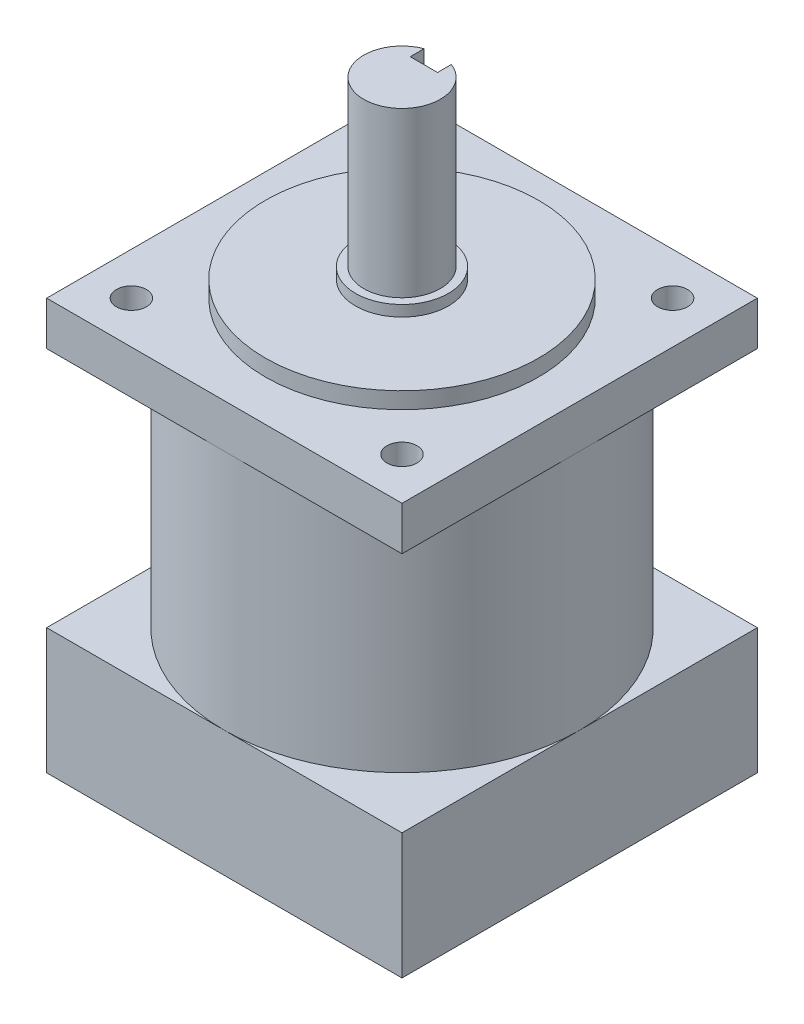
ISO-10303-21;
HEADER;
FILE_DESCRIPTION(('STEP AP214'),'2;1');
FILE_NAME('part.step','',(''),(''),'','','');
FILE_SCHEMA(('AUTOMOTIVE_DESIGN { 1 0 10303 214 1 1 1 1 }'));
ENDSEC;
DATA;
#1=APPLICATION_CONTEXT('core data for automotive mechanical design processes');
#2=APPLICATION_PROTOCOL_DEFINITION('international standard','automotive_design',2000,#1);
#3=PRODUCT_CONTEXT('',#1,'mechanical');
#4=PRODUCT('Part','Part','',(#3));
#5=PRODUCT_RELATED_PRODUCT_CATEGORY('part','',(#4));
#6=PRODUCT_DEFINITION_FORMATION('','',#4);
#7=PRODUCT_DEFINITION_CONTEXT('part definition',#1,'design');
#8=PRODUCT_DEFINITION('design','',#6,#7);
#9=PRODUCT_DEFINITION_SHAPE('','',#8);
#10=(LENGTH_UNIT() NAMED_UNIT(*) SI_UNIT(.MILLI.,.METRE.));
#11=(NAMED_UNIT(*) PLANE_ANGLE_UNIT() SI_UNIT($,.RADIAN.));
#12=(NAMED_UNIT(*) SI_UNIT($,.STERADIAN.) SOLID_ANGLE_UNIT());
#13=UNCERTAINTY_MEASURE_WITH_UNIT(LENGTH_MEASURE(1.E-05),#10,'distance_accuracy_value','');
#14=(GEOMETRIC_REPRESENTATION_CONTEXT(3) GLOBAL_UNCERTAINTY_ASSIGNED_CONTEXT((#13)) GLOBAL_UNIT_ASSIGNED_CONTEXT((#10,
#11,#12)) REPRESENTATION_CONTEXT('',''));
#15=CARTESIAN_POINT('',(0.,0.,0.));
#16=DIRECTION('',(0.,0.,1.));
#17=DIRECTION('',(1.,0.,0.));
#18=AXIS2_PLACEMENT_3D('',#15,#16,#17);
#19=CARTESIAN_POINT('',(0.,13.,0.));
#20=DIRECTION('',(0.,1.,0.));
#21=DIRECTION('',(0.,0.,1.));
#22=AXIS2_PLACEMENT_3D('',#19,#20,#21);
#23=PLANE('',#22);
#24=CARTESIAN_POINT('',(0.,13.,0.));
#25=DIRECTION('',(0.,1.,0.));
#26=DIRECTION('',(0.,0.,1.));
#27=AXIS2_PLACEMENT_3D('',#24,#25,#26);
#28=CIRCLE('',#27,8.5);
#29=CARTESIAN_POINT('',(0.,13.,8.5));
#30=VERTEX_POINT('',#29);
#31=EDGE_CURVE('E277',#30,#30,#28,.T.);
#32=ORIENTED_EDGE('',*,*,#31,.T.);
#33=EDGE_LOOP('',(#32));
#34=FACE_BOUND('',#33,.T.);
#35=DIRECTION('',(0.,0.,-1.));
#36=VECTOR('',#35,1.);
#37=CARTESIAN_POINT('',(2.5,13.,-9.));
#38=LINE('',#37,#36);
#39=CARTESIAN_POINT('',(2.5,13.,-4.));
#40=VERTEX_POINT('',#39);
#41=CARTESIAN_POINT('',(2.5,13.,-6.53834841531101));
#42=VERTEX_POINT('',#41);
#43=EDGE_CURVE('E835',#40,#42,#38,.T.);
#44=ORIENTED_EDGE('',*,*,#43,.T.);
#45=CARTESIAN_POINT('',(0.,13.,0.));
#46=DIRECTION('',(0.,1.,0.));
#47=DIRECTION('',(0.,0.,1.));
#48=AXIS2_PLACEMENT_3D('',#45,#46,#47);
#49=CIRCLE('',#48,7.);
#50=CARTESIAN_POINT('',(-2.5,13.,-6.53834841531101));
#51=VERTEX_POINT('',#50);
#52=EDGE_CURVE('E852',#51,#42,#49,.T.);
#53=ORIENTED_EDGE('',*,*,#52,.F.);
#54=DIRECTION('',(0.,0.,1.));
#55=VECTOR('',#54,1.);
#56=CARTESIAN_POINT('',(-2.5,13.,-9.));
#57=LINE('',#56,#55);
#58=CARTESIAN_POINT('',(-2.5,13.,-4.));
#59=VERTEX_POINT('',#58);
#60=EDGE_CURVE('E829',#51,#59,#57,.T.);
#61=ORIENTED_EDGE('',*,*,#60,.T.);
#62=DIRECTION('',(1.,0.,0.));
#63=VECTOR('',#62,1.);
#64=CARTESIAN_POINT('',(-2.5,13.,-4.));
#65=LINE('',#64,#63);
#66=EDGE_CURVE('E831',#59,#40,#65,.T.);
#67=ORIENTED_EDGE('',*,*,#66,.T.);
#68=EDGE_LOOP('',(#44,#53,#61,#67));
#69=FACE_BOUND('',#68,.T.);
#70=ADVANCED_FACE('F16',(#34,#69),#23,.T.);
#71=CARTESIAN_POINT('',(0.,11.,0.));
#72=DIRECTION('',(0.,1.,0.));
#73=DIRECTION('',(0.,0.,1.));
#74=AXIS2_PLACEMENT_3D('',#71,#72,#73);
#75=PLANE('',#74);
#76=CARTESIAN_POINT('',(0.,11.,0.));
#77=DIRECTION('',(0.,1.,0.));
#78=DIRECTION('',(0.,0.,1.));
#79=AXIS2_PLACEMENT_3D('',#76,#77,#78);
#80=CIRCLE('',#79,25.);
#81=CARTESIAN_POINT('',(0.,11.,25.));
#82=VERTEX_POINT('',#81);
#83=EDGE_CURVE('E250',#82,#82,#80,.T.);
#84=ORIENTED_EDGE('',*,*,#83,.T.);
#85=EDGE_LOOP('',(#84));
#86=FACE_BOUND('',#85,.T.);
#87=CARTESIAN_POINT('',(0.,11.,0.));
#88=DIRECTION('',(0.,1.,0.));
#89=DIRECTION('',(0.,0.,1.));
#90=AXIS2_PLACEMENT_3D('',#87,#88,#89);
#91=CIRCLE('',#90,8.5);
#92=CARTESIAN_POINT('',(0.,11.,8.5));
#93=VERTEX_POINT('',#92);
#94=EDGE_CURVE('E856',#93,#93,#91,.T.);
#95=ORIENTED_EDGE('',*,*,#94,.F.);
#96=EDGE_LOOP('',(#95));
#97=FACE_BOUND('',#96,.T.);
#98=ADVANCED_FACE('F324',(#86,#97),#75,.T.);
#99=CARTESIAN_POINT('',(32.5,0.,-32.5));
#100=DIRECTION('',(0.,-1.,0.));
#101=DIRECTION('',(0.,0.,-1.));
#102=AXIS2_PLACEMENT_3D('',#99,#100,#101);
#103=PLANE('',#102);
#104=CARTESIAN_POINT('',(24.7487373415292,0.,-24.7487373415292));
#105=DIRECTION('',(0.,-1.,0.));
#106=DIRECTION('',(0.,0.,-1.));
#107=AXIS2_PLACEMENT_3D('',#104,#105,#106);
#108=CIRCLE('',#107,2.75);
#109=CARTESIAN_POINT('',(22.1871999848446,0.,-23.7482242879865));
#110=VERTEX_POINT('',#109);
#111=CARTESIAN_POINT('',(23.7482242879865,0.,-22.1871999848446));
#112=VERTEX_POINT('',#111);
#113=EDGE_CURVE('E793',#110,#112,#108,.T.);
#114=ORIENTED_EDGE('',*,*,#113,.F.);
#115=CARTESIAN_POINT('',(0.,0.,0.));
#116=DIRECTION('',(0.,-1.,0.));
#117=DIRECTION('',(0.,0.,-1.));
#118=AXIS2_PLACEMENT_3D('',#115,#116,#117);
#119=CIRCLE('',#118,32.5);
#120=CARTESIAN_POINT('',(0.,0.,-32.5));
#121=VERTEX_POINT('',#120);
#122=EDGE_CURVE('E215',#121,#110,#119,.T.);
#123=ORIENTED_EDGE('',*,*,#122,.F.);
#124=DIRECTION('',(-1.,0.,0.));
#125=VECTOR('',#124,1.);
#126=CARTESIAN_POINT('',(-32.5,0.,-32.5));
#127=LINE('',#126,#125);
#128=CARTESIAN_POINT('',(32.5,0.,-32.5));
#129=VERTEX_POINT('',#128);
#130=EDGE_CURVE('E917',#129,#121,#127,.T.);
#131=ORIENTED_EDGE('',*,*,#130,.F.);
#132=DIRECTION('',(0.,0.,-1.));
#133=VECTOR('',#132,1.);
#134=CARTESIAN_POINT('',(32.5,0.,-32.5));
#135=LINE('',#134,#133);
#136=CARTESIAN_POINT('',(32.5,0.,0.));
#137=VERTEX_POINT('',#136);
#138=EDGE_CURVE('E949',#137,#129,#135,.T.);
#139=ORIENTED_EDGE('',*,*,#138,.F.);
#140=EDGE_CURVE('E214',#112,#137,#119,.T.);
#141=ORIENTED_EDGE('',*,*,#140,.F.);
#142=EDGE_LOOP('',(#114,#123,#131,#139,#141));
#143=FACE_BOUND('',#142,.T.);
#144=ADVANCED_FACE('F331',(#143),#103,.T.);
#145=CARTESIAN_POINT('',(24.7487373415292,0.,24.7487373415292));
#146=DIRECTION('',(0.,-1.,0.));
#147=DIRECTION('',(0.,0.,-1.));
#148=AXIS2_PLACEMENT_3D('',#145,#146,#147);
#149=CIRCLE('',#148,2.75);
#150=CARTESIAN_POINT('',(23.7482242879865,0.,22.1871999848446));
#151=VERTEX_POINT('',#150);
#152=CARTESIAN_POINT('',(22.1871999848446,0.,23.7482242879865));
#153=VERTEX_POINT('',#152);
#154=EDGE_CURVE('E786',#151,#153,#149,.T.);
#155=ORIENTED_EDGE('',*,*,#154,.F.);
#156=EDGE_CURVE('E213',#137,#151,#119,.T.);
#157=ORIENTED_EDGE('',*,*,#156,.F.);
#158=CARTESIAN_POINT('',(32.5,0.,32.5));
#159=VERTEX_POINT('',#158);
#160=EDGE_CURVE('E950',#159,#137,#135,.T.);
#161=ORIENTED_EDGE('',*,*,#160,.F.);
#162=DIRECTION('',(1.,0.,0.));
#163=VECTOR('',#162,1.);
#164=CARTESIAN_POINT('',(-32.5,0.,32.5));
#165=LINE('',#164,#163);
#166=CARTESIAN_POINT('',(0.,0.,32.5));
#167=VERTEX_POINT('',#166);
#168=EDGE_CURVE('E945',#167,#159,#165,.T.);
#169=ORIENTED_EDGE('',*,*,#168,.F.);
#170=EDGE_CURVE('E206',#153,#167,#119,.T.);
#171=ORIENTED_EDGE('',*,*,#170,.F.);
#172=EDGE_LOOP('',(#155,#157,#161,#169,#171));
#173=FACE_BOUND('',#172,.T.);
#174=ADVANCED_FACE('F457',(#173),#103,.T.);
#175=CARTESIAN_POINT('',(-24.7487373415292,0.,24.7487373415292));
#176=DIRECTION('',(0.,-1.,0.));
#177=DIRECTION('',(0.,0.,-1.));
#178=AXIS2_PLACEMENT_3D('',#175,#176,#177);
#179=CIRCLE('',#178,2.75);
#180=CARTESIAN_POINT('',(-22.1871999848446,0.,23.7482242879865));
#181=VERTEX_POINT('',#180);
#182=CARTESIAN_POINT('',(-23.7482242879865,0.,22.1871999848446));
#183=VERTEX_POINT('',#182);
#184=EDGE_CURVE('E196',#181,#183,#179,.T.);
#185=ORIENTED_EDGE('',*,*,#184,.F.);
#186=EDGE_CURVE('E203',#167,#181,#119,.T.);
#187=ORIENTED_EDGE('',*,*,#186,.F.);
#188=CARTESIAN_POINT('',(-32.5,0.,32.5));
#189=VERTEX_POINT('',#188);
#190=EDGE_CURVE('E941',#189,#167,#165,.T.);
#191=ORIENTED_EDGE('',*,*,#190,.F.);
#192=DIRECTION('',(0.,0.,1.));
#193=VECTOR('',#192,1.);
#194=CARTESIAN_POINT('',(-32.5,0.,-32.5));
#195=LINE('',#194,#193);
#196=CARTESIAN_POINT('',(-32.5,0.,0.));
#197=VERTEX_POINT('',#196);
#198=EDGE_CURVE('E939',#197,#189,#195,.T.);
#199=ORIENTED_EDGE('',*,*,#198,.F.);
#200=EDGE_CURVE('E210',#183,#197,#119,.T.);
#201=ORIENTED_EDGE('',*,*,#200,.F.);
#202=EDGE_LOOP('',(#185,#187,#191,#199,#201));
#203=FACE_BOUND('',#202,.T.);
#204=ADVANCED_FACE('F401',(#203),#103,.T.);
#205=CARTESIAN_POINT('',(32.5,8.,-32.5));
#206=DIRECTION('',(0.,-1.,0.));
#207=DIRECTION('',(0.,0.,-1.));
#208=AXIS2_PLACEMENT_3D('',#205,#206,#207);
#209=PLANE('',#208);
#210=CARTESIAN_POINT('',(-24.7487373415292,8.,24.7487373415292));
#211=DIRECTION('',(0.,1.,0.));
#212=DIRECTION('',(0.,0.,1.));
#213=AXIS2_PLACEMENT_3D('',#210,#211,#212);
#214=CIRCLE('',#213,2.75);
#215=CARTESIAN_POINT('',(-24.7487373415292,8.,27.4987373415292));
#216=VERTEX_POINT('',#215);
#217=EDGE_CURVE('E197',#216,#216,#214,.T.);
#218=ORIENTED_EDGE('',*,*,#217,.F.);
#219=EDGE_LOOP('',(#218));
#220=FACE_BOUND('',#219,.T.);
#221=CARTESIAN_POINT('',(24.7487373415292,8.,24.7487373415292));
#222=DIRECTION('',(0.,1.,0.));
#223=DIRECTION('',(0.,0.,1.));
#224=AXIS2_PLACEMENT_3D('',#221,#222,#223);
#225=CIRCLE('',#224,2.75);
#226=CARTESIAN_POINT('',(24.7487373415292,8.,27.4987373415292));
#227=VERTEX_POINT('',#226);
#228=EDGE_CURVE('E784',#227,#227,#225,.T.);
#229=ORIENTED_EDGE('',*,*,#228,.F.);
#230=EDGE_LOOP('',(#229));
#231=FACE_BOUND('',#230,.T.);
#232=CARTESIAN_POINT('',(24.7487373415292,8.,-24.7487373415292));
#233=DIRECTION('',(0.,1.,0.));
#234=DIRECTION('',(0.,0.,1.));
#235=AXIS2_PLACEMENT_3D('',#232,#233,#234);
#236=CIRCLE('',#235,2.75);
#237=CARTESIAN_POINT('',(24.7487373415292,8.,-21.9987373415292));
#238=VERTEX_POINT('',#237);
#239=EDGE_CURVE('E790',#238,#238,#236,.T.);
#240=ORIENTED_EDGE('',*,*,#239,.F.);
#241=EDGE_LOOP('',(#240));
#242=FACE_BOUND('',#241,.T.);
#243=CARTESIAN_POINT('',(-24.7487373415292,8.,-24.7487373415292));
#244=DIRECTION('',(0.,1.,0.));
#245=DIRECTION('',(0.,0.,1.));
#246=AXIS2_PLACEMENT_3D('',#243,#244,#245);
#247=CIRCLE('',#246,2.75);
#248=CARTESIAN_POINT('',(-24.7487373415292,8.,-21.9987373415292));
#249=VERTEX_POINT('',#248);
#250=EDGE_CURVE('E797',#249,#249,#247,.T.);
#251=ORIENTED_EDGE('',*,*,#250,.F.);
#252=EDGE_LOOP('',(#251));
#253=FACE_BOUND('',#252,.T.);
#254=DIRECTION('',(-1.,0.,0.));
#255=VECTOR('',#254,1.);
#256=CARTESIAN_POINT('',(-32.5,8.,-32.5));
#257=LINE('',#256,#255);
#258=CARTESIAN_POINT('',(32.5,8.,-32.5));
#259=VERTEX_POINT('',#258);
#260=CARTESIAN_POINT('',(-32.5,8.,-32.5));
#261=VERTEX_POINT('',#260);
#262=EDGE_CURVE('E953',#259,#261,#257,.T.);
#263=ORIENTED_EDGE('',*,*,#262,.T.);
#264=DIRECTION('',(0.,0.,1.));
#265=VECTOR('',#264,1.);
#266=CARTESIAN_POINT('',(-32.5,8.,-32.5));
#267=LINE('',#266,#265);
#268=CARTESIAN_POINT('',(-32.5,8.,32.5));
#269=VERTEX_POINT('',#268);
#270=EDGE_CURVE('E975',#261,#269,#267,.T.);
#271=ORIENTED_EDGE('',*,*,#270,.T.);
#272=DIRECTION('',(1.,0.,0.));
#273=VECTOR('',#272,1.);
#274=CARTESIAN_POINT('',(-32.5,8.,32.5));
#275=LINE('',#274,#273);
#276=CARTESIAN_POINT('',(32.5,8.,32.5));
#277=VERTEX_POINT('',#276);
#278=EDGE_CURVE('E974',#269,#277,#275,.T.);
#279=ORIENTED_EDGE('',*,*,#278,.T.);
#280=DIRECTION('',(0.,0.,-1.));
#281=VECTOR('',#280,1.);
#282=CARTESIAN_POINT('',(32.5,8.,-32.5));
#283=LINE('',#282,#281);
#284=EDGE_CURVE('E958',#277,#259,#283,.T.);
#285=ORIENTED_EDGE('',*,*,#284,.T.);
#286=EDGE_LOOP('',(#263,#271,#279,#285));
#287=FACE_BOUND('',#286,.T.);
#288=CARTESIAN_POINT('',(0.,8.,0.));
#289=DIRECTION('',(0.,-1.,0.));
#290=DIRECTION('',(0.,0.,-1.));
#291=AXIS2_PLACEMENT_3D('',#288,#289,#290);
#292=CIRCLE('',#291,25.);
#293=CARTESIAN_POINT('',(0.,8.,-25.));
#294=VERTEX_POINT('',#293);
#295=EDGE_CURVE('E226',#294,#294,#292,.F.);
#296=ORIENTED_EDGE('',*,*,#295,.F.);
#297=EDGE_LOOP('',(#296));
#298=FACE_BOUND('',#297,.T.);
#299=ADVANCED_FACE('F438',(#220,#231,#242,#253,#287,#298),#209,.F.);
#300=CARTESIAN_POINT('',(-32.5,8.,-32.5));
#301=DIRECTION('',(0.,0.,1.));
#302=DIRECTION('',(1.,0.,0.));
#303=AXIS2_PLACEMENT_3D('',#300,#301,#302);
#304=PLANE('',#303);
#305=ORIENTED_EDGE('',*,*,#130,.T.);
#306=CARTESIAN_POINT('',(-32.5,0.,-32.5));
#307=VERTEX_POINT('',#306);
#308=EDGE_CURVE('E257',#121,#307,#127,.T.);
#309=ORIENTED_EDGE('',*,*,#308,.T.);
#310=DIRECTION('',(0.,-1.,0.));
#311=VECTOR('',#310,1.);
#312=CARTESIAN_POINT('',(-32.5,8.,-32.5));
#313=LINE('',#312,#311);
#314=EDGE_CURVE('E232',#261,#307,#313,.T.);
#315=ORIENTED_EDGE('',*,*,#314,.F.);
#316=ORIENTED_EDGE('',*,*,#262,.F.);
#317=DIRECTION('',(0.,-1.,0.));
#318=VECTOR('',#317,1.);
#319=CARTESIAN_POINT('',(32.5,8.,-32.5));
#320=LINE('',#319,#318);
#321=EDGE_CURVE('E954',#259,#129,#320,.T.);
#322=ORIENTED_EDGE('',*,*,#321,.T.);
#323=EDGE_LOOP('',(#305,#309,#315,#316,#322));
#324=FACE_BOUND('',#323,.T.);
#325=ADVANCED_FACE('F18',(#324),#304,.F.);
#326=CARTESIAN_POINT('',(-32.5,8.,-32.5));
#327=DIRECTION('',(1.,0.,0.));
#328=DIRECTION('',(0.,0.,-1.));
#329=AXIS2_PLACEMENT_3D('',#326,#327,#328);
#330=PLANE('',#329);
#331=EDGE_CURVE('E914',#307,#197,#195,.T.);
#332=ORIENTED_EDGE('',*,*,#331,.T.);
#333=ORIENTED_EDGE('',*,*,#198,.T.);
#334=DIRECTION('',(0.,-1.,0.));
#335=VECTOR('',#334,1.);
#336=CARTESIAN_POINT('',(-32.5,8.,32.5));
#337=LINE('',#336,#335);
#338=EDGE_CURVE('E961',#269,#189,#337,.T.);
#339=ORIENTED_EDGE('',*,*,#338,.F.);
#340=ORIENTED_EDGE('',*,*,#270,.F.);
#341=ORIENTED_EDGE('',*,*,#314,.T.);
#342=EDGE_LOOP('',(#332,#333,#339,#340,#341));
#343=FACE_BOUND('',#342,.T.);
#344=ADVANCED_FACE('F421',(#343),#330,.F.);
#345=CARTESIAN_POINT('',(-32.5,8.,32.5));
#346=DIRECTION('',(0.,0.,-1.));
#347=DIRECTION('',(-1.,0.,0.));
#348=AXIS2_PLACEMENT_3D('',#345,#346,#347);
#349=PLANE('',#348);
#350=ORIENTED_EDGE('',*,*,#190,.T.);
#351=ORIENTED_EDGE('',*,*,#168,.T.);
#352=DIRECTION('',(0.,-1.,0.));
#353=VECTOR('',#352,1.);
#354=CARTESIAN_POINT('',(32.5,8.,32.5));
#355=LINE('',#354,#353);
#356=EDGE_CURVE('E957',#277,#159,#355,.T.);
#357=ORIENTED_EDGE('',*,*,#356,.F.);
#358=ORIENTED_EDGE('',*,*,#278,.F.);
#359=ORIENTED_EDGE('',*,*,#338,.T.);
#360=EDGE_LOOP('',(#350,#351,#357,#358,#359));
#361=FACE_BOUND('',#360,.T.);
#362=ADVANCED_FACE('F411',(#361),#349,.F.);
#363=CARTESIAN_POINT('',(32.5,8.,-32.5));
#364=DIRECTION('',(-1.,0.,0.));
#365=DIRECTION('',(0.,0.,1.));
#366=AXIS2_PLACEMENT_3D('',#363,#364,#365);
#367=PLANE('',#366);
#368=ORIENTED_EDGE('',*,*,#160,.T.);
#369=ORIENTED_EDGE('',*,*,#138,.T.);
#370=ORIENTED_EDGE('',*,*,#321,.F.);
#371=ORIENTED_EDGE('',*,*,#284,.F.);
#372=ORIENTED_EDGE('',*,*,#356,.T.);
#373=EDGE_LOOP('',(#368,#369,#370,#371,#372));
#374=FACE_BOUND('',#373,.T.);
#375=ADVANCED_FACE('F398',(#374),#367,.F.);
#376=CARTESIAN_POINT('',(-24.7487373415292,0.,-24.7487373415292));
#377=DIRECTION('',(0.,-1.,0.));
#378=DIRECTION('',(0.,0.,-1.));
#379=AXIS2_PLACEMENT_3D('',#376,#377,#378);
#380=CIRCLE('',#379,2.75);
#381=CARTESIAN_POINT('',(-23.7482242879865,0.,-22.1871999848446));
#382=VERTEX_POINT('',#381);
#383=CARTESIAN_POINT('',(-22.1871999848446,0.,-23.7482242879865));
#384=VERTEX_POINT('',#383);
#385=EDGE_CURVE('E800',#382,#384,#380,.T.);
#386=ORIENTED_EDGE('',*,*,#385,.F.);
#387=EDGE_CURVE('E212',#197,#382,#119,.T.);
#388=ORIENTED_EDGE('',*,*,#387,.F.);
#389=ORIENTED_EDGE('',*,*,#331,.F.);
#390=ORIENTED_EDGE('',*,*,#308,.F.);
#391=EDGE_CURVE('E219',#384,#121,#119,.T.);
#392=ORIENTED_EDGE('',*,*,#391,.F.);
#393=EDGE_LOOP('',(#386,#388,#389,#390,#392));
#394=FACE_BOUND('',#393,.T.);
#395=ADVANCED_FACE('F318',(#394),#103,.T.);
#396=CARTESIAN_POINT('',(0.,11.,0.));
#397=DIRECTION('',(0.,-1.,0.));
#398=DIRECTION('',(0.,0.,-1.));
#399=AXIS2_PLACEMENT_3D('',#396,#397,#398);
#400=CYLINDRICAL_SURFACE('',#399,25.);
#401=ORIENTED_EDGE('',*,*,#83,.F.);
#402=EDGE_LOOP('',(#401));
#403=FACE_BOUND('',#402,.T.);
#404=ORIENTED_EDGE('',*,*,#295,.T.);
#405=EDGE_LOOP('',(#404));
#406=FACE_BOUND('',#405,.T.);
#407=ADVANCED_FACE('F309',(#403,#406),#400,.T.);
#408=CARTESIAN_POINT('',(0.,-44.2,0.));
#409=DIRECTION('',(0.,1.,0.));
#410=DIRECTION('',(0.,0.,1.));
#411=AXIS2_PLACEMENT_3D('',#408,#409,#410);
#412=CYLINDRICAL_SURFACE('',#411,32.5);
#413=ORIENTED_EDGE('',*,*,#186,.T.);
#414=DIRECTION('',(0.,1.,0.));
#415=VECTOR('',#414,1.);
#416=CARTESIAN_POINT('',(-22.1871999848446,3.,23.7482242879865));
#417=LINE('',#416,#415);
#418=CARTESIAN_POINT('',(-22.1871999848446,-2.,23.7482242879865));
#419=VERTEX_POINT('',#418);
#420=EDGE_CURVE('E11',#181,#419,#417,.F.);
#421=ORIENTED_EDGE('',*,*,#420,.T.);
#422=CARTESIAN_POINT('',(0.,-2.,0.));
#423=DIRECTION('',(0.,1.,0.));
#424=DIRECTION('',(0.,0.,1.));
#425=AXIS2_PLACEMENT_3D('',#422,#423,#424);
#426=CIRCLE('',#425,32.5);
#427=CARTESIAN_POINT('',(-23.7482242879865,-2.,22.1871999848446));
#428=VERTEX_POINT('',#427);
#429=EDGE_CURVE('E187',#428,#419,#426,.T.);
#430=ORIENTED_EDGE('',*,*,#429,.F.);
#431=DIRECTION('',(0.,1.,0.));
#432=VECTOR('',#431,1.);
#433=CARTESIAN_POINT('',(-23.7482242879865,3.,22.1871999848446));
#434=LINE('',#433,#432);
#435=EDGE_CURVE('E24',#428,#183,#434,.T.);
#436=ORIENTED_EDGE('',*,*,#435,.T.);
#437=ORIENTED_EDGE('',*,*,#200,.T.);
#438=ORIENTED_EDGE('',*,*,#387,.T.);
#439=DIRECTION('',(0.,1.,0.));
#440=VECTOR('',#439,1.);
#441=CARTESIAN_POINT('',(-23.7482242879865,3.,-22.1871999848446));
#442=LINE('',#441,#440);
#443=CARTESIAN_POINT('',(-23.7482242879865,-2.,-22.1871999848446));
#444=VERTEX_POINT('',#443);
#445=EDGE_CURVE('E907',#382,#444,#442,.F.);
#446=ORIENTED_EDGE('',*,*,#445,.T.);
#447=CARTESIAN_POINT('',(0.,-2.,0.));
#448=DIRECTION('',(0.,1.,0.));
#449=DIRECTION('',(0.,0.,1.));
#450=AXIS2_PLACEMENT_3D('',#447,#448,#449);
#451=CIRCLE('',#450,32.5);
#452=CARTESIAN_POINT('',(-22.1871999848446,-2.,-23.7482242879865));
#453=VERTEX_POINT('',#452);
#454=EDGE_CURVE('E224',#453,#444,#451,.T.);
#455=ORIENTED_EDGE('',*,*,#454,.F.);
#456=DIRECTION('',(0.,1.,0.));
#457=VECTOR('',#456,1.);
#458=CARTESIAN_POINT('',(-22.1871999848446,3.,-23.7482242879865));
#459=LINE('',#458,#457);
#460=EDGE_CURVE('E904',#453,#384,#459,.T.);
#461=ORIENTED_EDGE('',*,*,#460,.T.);
#462=ORIENTED_EDGE('',*,*,#391,.T.);
#463=ORIENTED_EDGE('',*,*,#122,.T.);
#464=DIRECTION('',(0.,1.,0.));
#465=VECTOR('',#464,1.);
#466=CARTESIAN_POINT('',(22.1871999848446,3.,-23.7482242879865));
#467=LINE('',#466,#465);
#468=CARTESIAN_POINT('',(22.1871999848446,-2.,-23.7482242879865));
#469=VERTEX_POINT('',#468);
#470=EDGE_CURVE('E924',#110,#469,#467,.F.);
#471=ORIENTED_EDGE('',*,*,#470,.T.);
#472=CARTESIAN_POINT('',(0.,-2.,0.));
#473=DIRECTION('',(0.,1.,0.));
#474=DIRECTION('',(0.,0.,1.));
#475=AXIS2_PLACEMENT_3D('',#472,#473,#474);
#476=CIRCLE('',#475,32.5);
#477=CARTESIAN_POINT('',(23.7482242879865,-2.,-22.1871999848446));
#478=VERTEX_POINT('',#477);
#479=EDGE_CURVE('E925',#478,#469,#476,.T.);
#480=ORIENTED_EDGE('',*,*,#479,.F.);
#481=DIRECTION('',(0.,1.,0.));
#482=VECTOR('',#481,1.);
#483=CARTESIAN_POINT('',(23.7482242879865,3.,-22.1871999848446));
#484=LINE('',#483,#482);
#485=EDGE_CURVE('E929',#478,#112,#484,.T.);
#486=ORIENTED_EDGE('',*,*,#485,.T.);
#487=ORIENTED_EDGE('',*,*,#140,.T.);
#488=ORIENTED_EDGE('',*,*,#156,.T.);
#489=DIRECTION('',(0.,1.,0.));
#490=VECTOR('',#489,1.);
#491=CARTESIAN_POINT('',(23.7482242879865,3.,22.1871999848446));
#492=LINE('',#491,#490);
#493=CARTESIAN_POINT('',(23.7482242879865,-2.,22.1871999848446));
#494=VERTEX_POINT('',#493);
#495=EDGE_CURVE('E191',#151,#494,#492,.F.);
#496=ORIENTED_EDGE('',*,*,#495,.T.);
#497=CARTESIAN_POINT('',(0.,-2.,0.));
#498=DIRECTION('',(0.,1.,0.));
#499=DIRECTION('',(0.,0.,1.));
#500=AXIS2_PLACEMENT_3D('',#497,#498,#499);
#501=CIRCLE('',#500,32.5);
#502=CARTESIAN_POINT('',(22.1871999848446,-2.,23.7482242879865));
#503=VERTEX_POINT('',#502);
#504=EDGE_CURVE('E928',#503,#494,#501,.T.);
#505=ORIENTED_EDGE('',*,*,#504,.F.);
#506=DIRECTION('',(0.,1.,0.));
#507=VECTOR('',#506,1.);
#508=CARTESIAN_POINT('',(22.1871999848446,3.,23.7482242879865));
#509=LINE('',#508,#507);
#510=EDGE_CURVE('E931',#503,#153,#509,.T.);
#511=ORIENTED_EDGE('',*,*,#510,.T.);
#512=ORIENTED_EDGE('',*,*,#170,.T.);
#513=EDGE_LOOP('',(#413,#421,#430,#436,#437,#438,#446,#455,#461,#462,#463,#471,#480,#486,#487,
#488,#496,#505,#511,#512));
#514=FACE_BOUND('',#513,.T.);
#515=CARTESIAN_POINT('',(0.,-44.2,0.));
#516=DIRECTION('',(0.,-1.,0.));
#517=DIRECTION('',(0.,0.,-1.));
#518=AXIS2_PLACEMENT_3D('',#515,#516,#517);
#519=CIRCLE('',#518,32.5);
#520=CARTESIAN_POINT('',(0.,-44.2,-32.5));
#521=VERTEX_POINT('',#520);
#522=CARTESIAN_POINT('',(32.5,-44.2,0.));
#523=VERTEX_POINT('',#522);
#524=EDGE_CURVE('E248',#521,#523,#519,.T.);
#525=ORIENTED_EDGE('',*,*,#524,.F.);
#526=CARTESIAN_POINT('',(-32.5,-44.2,0.));
#527=VERTEX_POINT('',#526);
#528=EDGE_CURVE('E237',#527,#521,#519,.T.);
#529=ORIENTED_EDGE('',*,*,#528,.F.);
#530=CARTESIAN_POINT('',(0.,-44.2,32.5));
#531=VERTEX_POINT('',#530);
#532=EDGE_CURVE('E259',#531,#527,#519,.T.);
#533=ORIENTED_EDGE('',*,*,#532,.F.);
#534=EDGE_CURVE('E251',#523,#531,#519,.T.);
#535=ORIENTED_EDGE('',*,*,#534,.F.);
#536=EDGE_LOOP('',(#525,#529,#533,#535));
#537=FACE_BOUND('',#536,.T.);
#538=ADVANCED_FACE('F200',(#514,#537),#412,.T.);
#539=CARTESIAN_POINT('',(-32.5,-44.2,-32.5));
#540=DIRECTION('',(0.,-1.,0.));
#541=DIRECTION('',(0.,0.,-1.));
#542=AXIS2_PLACEMENT_3D('',#539,#540,#541);
#543=PLANE('',#542);
#544=DIRECTION('',(1.,0.,0.));
#545=VECTOR('',#544,1.);
#546=CARTESIAN_POINT('',(-32.5,-44.2,-32.5));
#547=LINE('',#546,#545);
#548=CARTESIAN_POINT('',(32.5,-44.2,-32.5));
#549=VERTEX_POINT('',#548);
#550=EDGE_CURVE('E284',#521,#549,#547,.T.);
#551=ORIENTED_EDGE('',*,*,#550,.F.);
#552=ORIENTED_EDGE('',*,*,#524,.T.);
#553=DIRECTION('',(0.,0.,1.));
#554=VECTOR('',#553,1.);
#555=CARTESIAN_POINT('',(32.5,-44.2,32.5));
#556=LINE('',#555,#554);
#557=EDGE_CURVE('E291',#549,#523,#556,.T.);
#558=ORIENTED_EDGE('',*,*,#557,.F.);
#559=EDGE_LOOP('',(#551,#552,#558));
#560=FACE_BOUND('',#559,.T.);
#561=ADVANCED_FACE('F308',(#560),#543,.F.);
#562=CARTESIAN_POINT('',(32.5,-44.2,32.5));
#563=VERTEX_POINT('',#562);
#564=EDGE_CURVE('E290',#523,#563,#556,.T.);
#565=ORIENTED_EDGE('',*,*,#564,.F.);
#566=ORIENTED_EDGE('',*,*,#534,.T.);
#567=DIRECTION('',(-1.,0.,0.));
#568=VECTOR('',#567,1.);
#569=CARTESIAN_POINT('',(-32.5,-44.2,32.5));
#570=LINE('',#569,#568);
#571=EDGE_CURVE('E294',#563,#531,#570,.T.);
#572=ORIENTED_EDGE('',*,*,#571,.F.);
#573=EDGE_LOOP('',(#565,#566,#572));
#574=FACE_BOUND('',#573,.T.);
#575=ADVANCED_FACE('F306',(#574),#543,.F.);
#576=CARTESIAN_POINT('',(-32.5,-44.2,32.5));
#577=VERTEX_POINT('',#576);
#578=EDGE_CURVE('E271',#531,#577,#570,.T.);
#579=ORIENTED_EDGE('',*,*,#578,.F.);
#580=ORIENTED_EDGE('',*,*,#532,.T.);
#581=DIRECTION('',(0.,0.,-1.));
#582=VECTOR('',#581,1.);
#583=CARTESIAN_POINT('',(-32.5,-44.2,32.5));
#584=LINE('',#583,#582);
#585=EDGE_CURVE('E270',#577,#527,#584,.T.);
#586=ORIENTED_EDGE('',*,*,#585,.F.);
#587=EDGE_LOOP('',(#579,#580,#586));
#588=FACE_BOUND('',#587,.T.);
#589=ADVANCED_FACE('F268',(#588),#543,.F.);
#590=CARTESIAN_POINT('',(-32.5,-44.2,-32.5));
#591=VERTEX_POINT('',#590);
#592=EDGE_CURVE('E273',#527,#591,#584,.T.);
#593=ORIENTED_EDGE('',*,*,#592,.F.);
#594=ORIENTED_EDGE('',*,*,#528,.T.);
#595=EDGE_CURVE('E275',#591,#521,#547,.T.);
#596=ORIENTED_EDGE('',*,*,#595,.F.);
#597=EDGE_LOOP('',(#593,#594,#596));
#598=FACE_BOUND('',#597,.T.);
#599=ADVANCED_FACE('F274',(#598),#543,.F.);
#600=CARTESIAN_POINT('',(-32.5,-67.2,32.5));
#601=DIRECTION('',(1.,0.,0.));
#602=DIRECTION('',(0.,0.,-1.));
#603=AXIS2_PLACEMENT_3D('',#600,#601,#602);
#604=PLANE('',#603);
#605=ORIENTED_EDGE('',*,*,#585,.T.);
#606=ORIENTED_EDGE('',*,*,#592,.T.);
#607=DIRECTION('',(0.,1.,0.));
#608=VECTOR('',#607,1.);
#609=CARTESIAN_POINT('',(-32.5,-67.2,-32.5));
#610=LINE('',#609,#608);
#611=CARTESIAN_POINT('',(-32.5,-67.2,-32.5));
#612=VERTEX_POINT('',#611);
#613=EDGE_CURVE('E234',#612,#591,#610,.T.);
#614=ORIENTED_EDGE('',*,*,#613,.F.);
#615=DIRECTION('',(0.,0.,-1.));
#616=VECTOR('',#615,1.);
#617=CARTESIAN_POINT('',(-32.5,-67.2,32.5));
#618=LINE('',#617,#616);
#619=CARTESIAN_POINT('',(-32.5,-67.2,32.5));
#620=VERTEX_POINT('',#619);
#621=EDGE_CURVE('E296',#620,#612,#618,.T.);
#622=ORIENTED_EDGE('',*,*,#621,.F.);
#623=DIRECTION('',(0.,1.,0.));
#624=VECTOR('',#623,1.);
#625=CARTESIAN_POINT('',(-32.5,-67.2,32.5));
#626=LINE('',#625,#624);
#627=EDGE_CURVE('E283',#620,#577,#626,.T.);
#628=ORIENTED_EDGE('',*,*,#627,.T.);
#629=EDGE_LOOP('',(#605,#606,#614,#622,#628));
#630=FACE_BOUND('',#629,.T.);
#631=ADVANCED_FACE('F280',(#630),#604,.F.);
#632=CARTESIAN_POINT('',(-32.5,-67.2,-32.5));
#633=DIRECTION('',(0.,0.,1.));
#634=DIRECTION('',(1.,0.,0.));
#635=AXIS2_PLACEMENT_3D('',#632,#633,#634);
#636=PLANE('',#635);
#637=ORIENTED_EDGE('',*,*,#595,.T.);
#638=ORIENTED_EDGE('',*,*,#550,.T.);
#639=DIRECTION('',(0.,1.,0.));
#640=VECTOR('',#639,1.);
#641=CARTESIAN_POINT('',(32.5,-67.2,-32.5));
#642=LINE('',#641,#640);
#643=CARTESIAN_POINT('',(32.5,-67.2,-32.5));
#644=VERTEX_POINT('',#643);
#645=EDGE_CURVE('E239',#644,#549,#642,.T.);
#646=ORIENTED_EDGE('',*,*,#645,.F.);
#647=DIRECTION('',(1.,0.,0.));
#648=VECTOR('',#647,1.);
#649=CARTESIAN_POINT('',(-32.5,-67.2,-32.5));
#650=LINE('',#649,#648);
#651=EDGE_CURVE('E864',#612,#644,#650,.T.);
#652=ORIENTED_EDGE('',*,*,#651,.F.);
#653=ORIENTED_EDGE('',*,*,#613,.T.);
#654=EDGE_LOOP('',(#637,#638,#646,#652,#653));
#655=FACE_BOUND('',#654,.T.);
#656=ADVANCED_FACE('F352',(#655),#636,.F.);
#657=CARTESIAN_POINT('',(32.5,-67.2,32.5));
#658=DIRECTION('',(-1.,0.,0.));
#659=DIRECTION('',(0.,0.,1.));
#660=AXIS2_PLACEMENT_3D('',#657,#658,#659);
#661=PLANE('',#660);
#662=ORIENTED_EDGE('',*,*,#557,.T.);
#663=ORIENTED_EDGE('',*,*,#564,.T.);
#664=DIRECTION('',(0.,1.,0.));
#665=VECTOR('',#664,1.);
#666=CARTESIAN_POINT('',(32.5,-67.2,32.5));
#667=LINE('',#666,#665);
#668=CARTESIAN_POINT('',(32.5,-67.2,32.5));
#669=VERTEX_POINT('',#668);
#670=EDGE_CURVE('E245',#669,#563,#667,.T.);
#671=ORIENTED_EDGE('',*,*,#670,.F.);
#672=DIRECTION('',(0.,0.,1.));
#673=VECTOR('',#672,1.);
#674=CARTESIAN_POINT('',(32.5,-67.2,32.5));
#675=LINE('',#674,#673);
#676=EDGE_CURVE('E865',#644,#669,#675,.T.);
#677=ORIENTED_EDGE('',*,*,#676,.F.);
#678=ORIENTED_EDGE('',*,*,#645,.T.);
#679=EDGE_LOOP('',(#662,#663,#671,#677,#678));
#680=FACE_BOUND('',#679,.T.);
#681=ADVANCED_FACE('F349',(#680),#661,.F.);
#682=CARTESIAN_POINT('',(-32.5,-67.2,32.5));
#683=DIRECTION('',(0.,0.,-1.));
#684=DIRECTION('',(-1.,0.,0.));
#685=AXIS2_PLACEMENT_3D('',#682,#683,#684);
#686=PLANE('',#685);
#687=ORIENTED_EDGE('',*,*,#571,.T.);
#688=ORIENTED_EDGE('',*,*,#578,.T.);
#689=ORIENTED_EDGE('',*,*,#627,.F.);
#690=DIRECTION('',(-1.,0.,0.));
#691=VECTOR('',#690,1.);
#692=CARTESIAN_POINT('',(-32.5,-67.2,32.5));
#693=LINE('',#692,#691);
#694=EDGE_CURVE('E287',#669,#620,#693,.T.);
#695=ORIENTED_EDGE('',*,*,#694,.F.);
#696=ORIENTED_EDGE('',*,*,#670,.T.);
#697=EDGE_LOOP('',(#687,#688,#689,#695,#696));
#698=FACE_BOUND('',#697,.T.);
#699=ADVANCED_FACE('F302',(#698),#686,.F.);
#700=CARTESIAN_POINT('',(-32.5,-67.2,-32.5));
#701=DIRECTION('',(0.,-1.,0.));
#702=DIRECTION('',(0.,0.,-1.));
#703=AXIS2_PLACEMENT_3D('',#700,#701,#702);
#704=PLANE('',#703);
#705=CARTESIAN_POINT('',(0.,-67.2,0.));
#706=DIRECTION('',(0.,-1.,0.));
#707=DIRECTION('',(0.,0.,-1.));
#708=AXIS2_PLACEMENT_3D('',#705,#706,#707);
#709=CIRCLE('',#708,25.);
#710=CARTESIAN_POINT('',(0.,-67.2,-25.));
#711=VERTEX_POINT('',#710);
#712=EDGE_CURVE('E770',#711,#711,#709,.T.);
#713=ORIENTED_EDGE('',*,*,#712,.F.);
#714=EDGE_LOOP('',(#713));
#715=FACE_BOUND('',#714,.T.);
#716=CARTESIAN_POINT('',(-24.7487373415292,-67.2,24.7487373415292));
#717=DIRECTION('',(0.,-1.,0.));
#718=DIRECTION('',(0.,0.,-1.));
#719=AXIS2_PLACEMENT_3D('',#716,#717,#718);
#720=CIRCLE('',#719,2.1);
#721=CARTESIAN_POINT('',(-24.7487373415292,-67.2,22.6487373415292));
#722=VERTEX_POINT('',#721);
#723=EDGE_CURVE('E804',#722,#722,#720,.T.);
#724=ORIENTED_EDGE('',*,*,#723,.F.);
#725=EDGE_LOOP('',(#724));
#726=FACE_BOUND('',#725,.T.);
#727=CARTESIAN_POINT('',(24.7487373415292,-67.2,24.7487373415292));
#728=DIRECTION('',(0.,-1.,0.));
#729=DIRECTION('',(0.,0.,-1.));
#730=AXIS2_PLACEMENT_3D('',#727,#728,#729);
#731=CIRCLE('',#730,2.1);
#732=CARTESIAN_POINT('',(24.7487373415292,-67.2,22.6487373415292));
#733=VERTEX_POINT('',#732);
#734=EDGE_CURVE('E810',#733,#733,#731,.T.);
#735=ORIENTED_EDGE('',*,*,#734,.F.);
#736=EDGE_LOOP('',(#735));
#737=FACE_BOUND('',#736,.T.);
#738=CARTESIAN_POINT('',(24.7487373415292,-67.2,-24.7487373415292));
#739=DIRECTION('',(0.,-1.,0.));
#740=DIRECTION('',(0.,0.,-1.));
#741=AXIS2_PLACEMENT_3D('',#738,#739,#740);
#742=CIRCLE('',#741,2.1);
#743=CARTESIAN_POINT('',(24.7487373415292,-67.2,-26.8487373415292));
#744=VERTEX_POINT('',#743);
#745=EDGE_CURVE('E816',#744,#744,#742,.T.);
#746=ORIENTED_EDGE('',*,*,#745,.F.);
#747=EDGE_LOOP('',(#746));
#748=FACE_BOUND('',#747,.T.);
#749=CARTESIAN_POINT('',(-24.7487373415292,-67.2,-24.7487373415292));
#750=DIRECTION('',(0.,-1.,0.));
#751=DIRECTION('',(0.,0.,-1.));
#752=AXIS2_PLACEMENT_3D('',#749,#750,#751);
#753=CIRCLE('',#752,2.1);
#754=CARTESIAN_POINT('',(-24.7487373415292,-67.2,-26.8487373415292));
#755=VERTEX_POINT('',#754);
#756=EDGE_CURVE('E822',#755,#755,#753,.T.);
#757=ORIENTED_EDGE('',*,*,#756,.F.);
#758=EDGE_LOOP('',(#757));
#759=FACE_BOUND('',#758,.T.);
#760=ORIENTED_EDGE('',*,*,#621,.T.);
#761=ORIENTED_EDGE('',*,*,#651,.T.);
#762=ORIENTED_EDGE('',*,*,#676,.T.);
#763=ORIENTED_EDGE('',*,*,#694,.T.);
#764=EDGE_LOOP('',(#760,#761,#762,#763));
#765=FACE_BOUND('',#764,.T.);
#766=ADVANCED_FACE('F342',(#715,#726,#737,#748,#759,#765),#704,.T.);
#767=CARTESIAN_POINT('',(0.,13.,0.));
#768=DIRECTION('',(0.,-1.,0.));
#769=DIRECTION('',(0.,0.,-1.));
#770=AXIS2_PLACEMENT_3D('',#767,#768,#769);
#771=CYLINDRICAL_SURFACE('',#770,8.5);
#772=ORIENTED_EDGE('',*,*,#31,.F.);
#773=EDGE_LOOP('',(#772));
#774=FACE_BOUND('',#773,.T.);
#775=ORIENTED_EDGE('',*,*,#94,.T.);
#776=EDGE_LOOP('',(#775));
#777=FACE_BOUND('',#776,.T.);
#778=ADVANCED_FACE('F339',(#774,#777),#771,.T.);
#779=CARTESIAN_POINT('',(0.,43.,0.));
#780=DIRECTION('',(0.,-1.,0.));
#781=DIRECTION('',(0.,0.,-1.));
#782=AXIS2_PLACEMENT_3D('',#779,#780,#781);
#783=CYLINDRICAL_SURFACE('',#782,7.);
#784=ORIENTED_EDGE('',*,*,#52,.T.);
#785=DIRECTION('',(0.,-1.,0.));
#786=VECTOR('',#785,1.);
#787=CARTESIAN_POINT('',(2.5,43.,-6.53834841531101));
#788=LINE('',#787,#786);
#789=CARTESIAN_POINT('',(2.5,43.,-6.53834841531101));
#790=VERTEX_POINT('',#789);
#791=EDGE_CURVE('E849',#42,#790,#788,.F.);
#792=ORIENTED_EDGE('',*,*,#791,.T.);
#793=CARTESIAN_POINT('',(0.,43.,0.));
#794=DIRECTION('',(0.,1.,0.));
#795=DIRECTION('',(0.,0.,1.));
#796=AXIS2_PLACEMENT_3D('',#793,#794,#795);
#797=CIRCLE('',#796,7.);
#798=CARTESIAN_POINT('',(-2.5,43.,-6.53834841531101));
#799=VERTEX_POINT('',#798);
#800=EDGE_CURVE('E853',#799,#790,#797,.T.);
#801=ORIENTED_EDGE('',*,*,#800,.F.);
#802=DIRECTION('',(0.,-1.,0.));
#803=VECTOR('',#802,1.);
#804=CARTESIAN_POINT('',(-2.5,43.,-6.53834841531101));
#805=LINE('',#804,#803);
#806=EDGE_CURVE('E844',#799,#51,#805,.T.);
#807=ORIENTED_EDGE('',*,*,#806,.T.);
#808=EDGE_LOOP('',(#784,#792,#801,#807));
#809=FACE_BOUND('',#808,.T.);
#810=ADVANCED_FACE('F337',(#809),#783,.T.);
#811=CARTESIAN_POINT('',(0.,43.,0.));
#812=DIRECTION('',(0.,1.,0.));
#813=DIRECTION('',(0.,0.,1.));
#814=AXIS2_PLACEMENT_3D('',#811,#812,#813);
#815=PLANE('',#814);
#816=DIRECTION('',(0.,0.,-1.));
#817=VECTOR('',#816,1.);
#818=CARTESIAN_POINT('',(2.5,43.,-9.));
#819=LINE('',#818,#817);
#820=CARTESIAN_POINT('',(2.5,43.,-4.));
#821=VERTEX_POINT('',#820);
#822=EDGE_CURVE('E832',#821,#790,#819,.T.);
#823=ORIENTED_EDGE('',*,*,#822,.F.);
#824=DIRECTION('',(1.,0.,0.));
#825=VECTOR('',#824,1.);
#826=CARTESIAN_POINT('',(-2.5,43.,-4.));
#827=LINE('',#826,#825);
#828=CARTESIAN_POINT('',(-2.5,43.,-4.));
#829=VERTEX_POINT('',#828);
#830=EDGE_CURVE('E828',#829,#821,#827,.T.);
#831=ORIENTED_EDGE('',*,*,#830,.F.);
#832=DIRECTION('',(0.,0.,1.));
#833=VECTOR('',#832,1.);
#834=CARTESIAN_POINT('',(-2.5,43.,0.));
#835=LINE('',#834,#833);
#836=EDGE_CURVE('E221',#799,#829,#835,.T.);
#837=ORIENTED_EDGE('',*,*,#836,.F.);
#838=ORIENTED_EDGE('',*,*,#800,.T.);
#839=EDGE_LOOP('',(#823,#831,#837,#838));
#840=FACE_BOUND('',#839,.T.);
#841=ADVANCED_FACE('F531',(#840),#815,.T.);
#842=CARTESIAN_POINT('',(2.5,13.,-9.));
#843=DIRECTION('',(1.,0.,0.));
#844=DIRECTION('',(0.,0.,-1.));
#845=AXIS2_PLACEMENT_3D('',#842,#843,#844);
#846=PLANE('',#845);
#847=ORIENTED_EDGE('',*,*,#43,.F.);
#848=DIRECTION('',(0.,1.,0.));
#849=VECTOR('',#848,1.);
#850=CARTESIAN_POINT('',(2.5,13.,-4.));
#851=LINE('',#850,#849);
#852=EDGE_CURVE('E842',#40,#821,#851,.T.);
#853=ORIENTED_EDGE('',*,*,#852,.T.);
#854=ORIENTED_EDGE('',*,*,#822,.T.);
#855=ORIENTED_EDGE('',*,*,#791,.F.);
#856=EDGE_LOOP('',(#847,#853,#854,#855));
#857=FACE_BOUND('',#856,.T.);
#858=ADVANCED_FACE('F538',(#857),#846,.F.);
#859=CARTESIAN_POINT('',(-2.5,13.,-9.));
#860=DIRECTION('',(-1.,0.,0.));
#861=DIRECTION('',(0.,0.,1.));
#862=AXIS2_PLACEMENT_3D('',#859,#860,#861);
#863=PLANE('',#862);
#864=ORIENTED_EDGE('',*,*,#836,.T.);
#865=DIRECTION('',(0.,1.,0.));
#866=VECTOR('',#865,1.);
#867=CARTESIAN_POINT('',(-2.5,13.,-4.));
#868=LINE('',#867,#866);
#869=EDGE_CURVE('E838',#59,#829,#868,.T.);
#870=ORIENTED_EDGE('',*,*,#869,.F.);
#871=ORIENTED_EDGE('',*,*,#60,.F.);
#872=ORIENTED_EDGE('',*,*,#806,.F.);
#873=EDGE_LOOP('',(#864,#870,#871,#872));
#874=FACE_BOUND('',#873,.T.);
#875=ADVANCED_FACE('F546',(#874),#863,.F.);
#876=CARTESIAN_POINT('',(-2.5,13.,-4.));
#877=DIRECTION('',(0.,0.,1.));
#878=DIRECTION('',(1.,0.,0.));
#879=AXIS2_PLACEMENT_3D('',#876,#877,#878);
#880=PLANE('',#879);
#881=ORIENTED_EDGE('',*,*,#830,.T.);
#882=ORIENTED_EDGE('',*,*,#852,.F.);
#883=ORIENTED_EDGE('',*,*,#66,.F.);
#884=ORIENTED_EDGE('',*,*,#869,.T.);
#885=EDGE_LOOP('',(#881,#882,#883,#884));
#886=FACE_BOUND('',#885,.T.);
#887=ADVANCED_FACE('F555',(#886),#880,.F.);
#888=CARTESIAN_POINT('',(-24.7487373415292,-53.2,-24.7487373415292));
#889=DIRECTION('',(0.,-1.,0.));
#890=DIRECTION('',(0.,0.,-1.));
#891=AXIS2_PLACEMENT_3D('',#888,#889,#890);
#892=CONICAL_SURFACE('',#891,2.1,1.02974425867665);
#893=CARTESIAN_POINT('',(-24.7487373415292,-51.9381927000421,-24.7487373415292));
#894=VERTEX_POINT('',#893);
#895=VERTEX_LOOP('',#894);
#896=FACE_BOUND('',#895,.T.);
#897=CARTESIAN_POINT('',(-24.7487373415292,-53.2,-24.7487373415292));
#898=DIRECTION('',(0.,-1.,0.));
#899=DIRECTION('',(0.,0.,-1.));
#900=AXIS2_PLACEMENT_3D('',#897,#898,#899);
#901=CIRCLE('',#900,2.1);
#902=CARTESIAN_POINT('',(-24.7487373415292,-53.2,-26.8487373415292));
#903=VERTEX_POINT('',#902);
#904=EDGE_CURVE('E825',#903,#903,#901,.T.);
#905=ORIENTED_EDGE('',*,*,#904,.T.);
#906=EDGE_LOOP('',(#905));
#907=FACE_BOUND('',#906,.T.);
#908=ADVANCED_FACE('F564',(#896,#907),#892,.F.);
#909=CARTESIAN_POINT('',(-24.7487373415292,-67.2,-24.7487373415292));
#910=DIRECTION('',(0.,-1.,0.));
#911=DIRECTION('',(0.,0.,-1.));
#912=AXIS2_PLACEMENT_3D('',#909,#910,#911);
#913=CYLINDRICAL_SURFACE('',#912,2.1);
#914=ORIENTED_EDGE('',*,*,#904,.F.);
#915=EDGE_LOOP('',(#914));
#916=FACE_BOUND('',#915,.T.);
#917=ORIENTED_EDGE('',*,*,#756,.T.);
#918=EDGE_LOOP('',(#917));
#919=FACE_BOUND('',#918,.T.);
#920=ADVANCED_FACE('F573',(#916,#919),#913,.F.);
#921=CARTESIAN_POINT('',(24.7487373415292,-53.2,-24.7487373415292));
#922=DIRECTION('',(0.,-1.,0.));
#923=DIRECTION('',(0.,0.,-1.));
#924=AXIS2_PLACEMENT_3D('',#921,#922,#923);
#925=CONICAL_SURFACE('',#924,2.1,1.02974425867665);
#926=CARTESIAN_POINT('',(24.7487373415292,-51.9381927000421,-24.7487373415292));
#927=VERTEX_POINT('',#926);
#928=VERTEX_LOOP('',#927);
#929=FACE_BOUND('',#928,.T.);
#930=CARTESIAN_POINT('',(24.7487373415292,-53.2,-24.7487373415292));
#931=DIRECTION('',(0.,-1.,0.));
#932=DIRECTION('',(0.,0.,-1.));
#933=AXIS2_PLACEMENT_3D('',#930,#931,#932);
#934=CIRCLE('',#933,2.1);
#935=CARTESIAN_POINT('',(24.7487373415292,-53.2,-26.8487373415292));
#936=VERTEX_POINT('',#935);
#937=EDGE_CURVE('E819',#936,#936,#934,.T.);
#938=ORIENTED_EDGE('',*,*,#937,.T.);
#939=EDGE_LOOP('',(#938));
#940=FACE_BOUND('',#939,.T.);
#941=ADVANCED_FACE('F582',(#929,#940),#925,.F.);
#942=CARTESIAN_POINT('',(24.7487373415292,-67.2,-24.7487373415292));
#943=DIRECTION('',(0.,-1.,0.));
#944=DIRECTION('',(0.,0.,-1.));
#945=AXIS2_PLACEMENT_3D('',#942,#943,#944);
#946=CYLINDRICAL_SURFACE('',#945,2.1);
#947=ORIENTED_EDGE('',*,*,#937,.F.);
#948=EDGE_LOOP('',(#947));
#949=FACE_BOUND('',#948,.T.);
#950=ORIENTED_EDGE('',*,*,#745,.T.);
#951=EDGE_LOOP('',(#950));
#952=FACE_BOUND('',#951,.T.);
#953=ADVANCED_FACE('F591',(#949,#952),#946,.F.);
#954=CARTESIAN_POINT('',(24.7487373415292,-53.2,24.7487373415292));
#955=DIRECTION('',(0.,-1.,0.));
#956=DIRECTION('',(0.,0.,-1.));
#957=AXIS2_PLACEMENT_3D('',#954,#955,#956);
#958=CONICAL_SURFACE('',#957,2.1,1.02974425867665);
#959=CARTESIAN_POINT('',(24.7487373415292,-51.9381927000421,24.7487373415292));
#960=VERTEX_POINT('',#959);
#961=VERTEX_LOOP('',#960);
#962=FACE_BOUND('',#961,.T.);
#963=CARTESIAN_POINT('',(24.7487373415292,-53.2,24.7487373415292));
#964=DIRECTION('',(0.,-1.,0.));
#965=DIRECTION('',(0.,0.,-1.));
#966=AXIS2_PLACEMENT_3D('',#963,#964,#965);
#967=CIRCLE('',#966,2.1);
#968=CARTESIAN_POINT('',(24.7487373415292,-53.2,22.6487373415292));
#969=VERTEX_POINT('',#968);
#970=EDGE_CURVE('E813',#969,#969,#967,.T.);
#971=ORIENTED_EDGE('',*,*,#970,.T.);
#972=EDGE_LOOP('',(#971));
#973=FACE_BOUND('',#972,.T.);
#974=ADVANCED_FACE('F600',(#962,#973),#958,.F.);
#975=CARTESIAN_POINT('',(24.7487373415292,-67.2,24.7487373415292));
#976=DIRECTION('',(0.,-1.,0.));
#977=DIRECTION('',(0.,0.,-1.));
#978=AXIS2_PLACEMENT_3D('',#975,#976,#977);
#979=CYLINDRICAL_SURFACE('',#978,2.1);
#980=ORIENTED_EDGE('',*,*,#970,.F.);
#981=EDGE_LOOP('',(#980));
#982=FACE_BOUND('',#981,.T.);
#983=ORIENTED_EDGE('',*,*,#734,.T.);
#984=EDGE_LOOP('',(#983));
#985=FACE_BOUND('',#984,.T.);
#986=ADVANCED_FACE('F609',(#982,#985),#979,.F.);
#987=CARTESIAN_POINT('',(-24.7487373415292,-53.2,24.7487373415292));
#988=DIRECTION('',(0.,-1.,0.));
#989=DIRECTION('',(0.,0.,-1.));
#990=AXIS2_PLACEMENT_3D('',#987,#988,#989);
#991=CONICAL_SURFACE('',#990,2.1,1.02974425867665);
#992=CARTESIAN_POINT('',(-24.7487373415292,-51.9381927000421,24.7487373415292));
#993=VERTEX_POINT('',#992);
#994=VERTEX_LOOP('',#993);
#995=FACE_BOUND('',#994,.T.);
#996=CARTESIAN_POINT('',(-24.7487373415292,-53.2,24.7487373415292));
#997=DIRECTION('',(0.,-1.,0.));
#998=DIRECTION('',(0.,0.,-1.));
#999=AXIS2_PLACEMENT_3D('',#996,#997,#998);
#1000=CIRCLE('',#999,2.1);
#1001=CARTESIAN_POINT('',(-24.7487373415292,-53.2,22.6487373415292));
#1002=VERTEX_POINT('',#1001);
#1003=EDGE_CURVE('E807',#1002,#1002,#1000,.T.);
#1004=ORIENTED_EDGE('',*,*,#1003,.T.);
#1005=EDGE_LOOP('',(#1004));
#1006=FACE_BOUND('',#1005,.T.);
#1007=ADVANCED_FACE('F618',(#995,#1006),#991,.F.);
#1008=CARTESIAN_POINT('',(-24.7487373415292,-67.2,24.7487373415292));
#1009=DIRECTION('',(0.,-1.,0.));
#1010=DIRECTION('',(0.,0.,-1.));
#1011=AXIS2_PLACEMENT_3D('',#1008,#1009,#1010);
#1012=CYLINDRICAL_SURFACE('',#1011,2.1);
#1013=ORIENTED_EDGE('',*,*,#1003,.F.);
#1014=EDGE_LOOP('',(#1013));
#1015=FACE_BOUND('',#1014,.T.);
#1016=ORIENTED_EDGE('',*,*,#723,.T.);
#1017=EDGE_LOOP('',(#1016));
#1018=FACE_BOUND('',#1017,.T.);
#1019=ADVANCED_FACE('F627',(#1015,#1018),#1012,.F.);
#1020=CARTESIAN_POINT('',(-24.7487373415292,-2.,-24.7487373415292));
#1021=DIRECTION('',(0.,1.,0.));
#1022=DIRECTION('',(0.,0.,1.));
#1023=AXIS2_PLACEMENT_3D('',#1020,#1021,#1022);
#1024=CYLINDRICAL_SURFACE('',#1023,2.75);
#1025=ORIENTED_EDGE('',*,*,#250,.T.);
#1026=EDGE_LOOP('',(#1025));
#1027=FACE_BOUND('',#1026,.T.);
#1028=ORIENTED_EDGE('',*,*,#385,.T.);
#1029=ORIENTED_EDGE('',*,*,#460,.F.);
#1030=CARTESIAN_POINT('',(-24.7487373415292,-2.,-24.7487373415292));
#1031=DIRECTION('',(0.,1.,0.));
#1032=DIRECTION('',(0.,0.,1.));
#1033=AXIS2_PLACEMENT_3D('',#1030,#1031,#1032);
#1034=CIRCLE('',#1033,2.75);
#1035=EDGE_CURVE('E798',#444,#453,#1034,.T.);
#1036=ORIENTED_EDGE('',*,*,#1035,.F.);
#1037=ORIENTED_EDGE('',*,*,#445,.F.);
#1038=EDGE_LOOP('',(#1028,#1029,#1036,#1037));
#1039=FACE_BOUND('',#1038,.T.);
#1040=ADVANCED_FACE('F636',(#1027,#1039),#1024,.F.);
#1041=CARTESIAN_POINT('',(-24.7487373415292,-2.,-24.7487373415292));
#1042=DIRECTION('',(0.,1.,0.));
#1043=DIRECTION('',(0.,0.,1.));
#1044=AXIS2_PLACEMENT_3D('',#1041,#1042,#1043);
#1045=PLANE('',#1044);
#1046=ORIENTED_EDGE('',*,*,#454,.T.);
#1047=ORIENTED_EDGE('',*,*,#1035,.T.);
#1048=EDGE_LOOP('',(#1046,#1047));
#1049=FACE_BOUND('',#1048,.T.);
#1050=ADVANCED_FACE('F645',(#1049),#1045,.T.);
#1051=CARTESIAN_POINT('',(24.7487373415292,-2.,-24.7487373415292));
#1052=DIRECTION('',(0.,1.,0.));
#1053=DIRECTION('',(0.,0.,1.));
#1054=AXIS2_PLACEMENT_3D('',#1051,#1052,#1053);
#1055=CYLINDRICAL_SURFACE('',#1054,2.75);
#1056=ORIENTED_EDGE('',*,*,#239,.T.);
#1057=EDGE_LOOP('',(#1056));
#1058=FACE_BOUND('',#1057,.T.);
#1059=ORIENTED_EDGE('',*,*,#113,.T.);
#1060=ORIENTED_EDGE('',*,*,#485,.F.);
#1061=CARTESIAN_POINT('',(24.7487373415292,-2.,-24.7487373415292));
#1062=DIRECTION('',(0.,1.,0.));
#1063=DIRECTION('',(0.,0.,1.));
#1064=AXIS2_PLACEMENT_3D('',#1061,#1062,#1063);
#1065=CIRCLE('',#1064,2.75);
#1066=EDGE_CURVE('E791',#469,#478,#1065,.T.);
#1067=ORIENTED_EDGE('',*,*,#1066,.F.);
#1068=ORIENTED_EDGE('',*,*,#470,.F.);
#1069=EDGE_LOOP('',(#1059,#1060,#1067,#1068));
#1070=FACE_BOUND('',#1069,.T.);
#1071=ADVANCED_FACE('F653',(#1058,#1070),#1055,.F.);
#1072=CARTESIAN_POINT('',(24.7487373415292,-2.,-24.7487373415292));
#1073=DIRECTION('',(0.,1.,0.));
#1074=DIRECTION('',(0.,0.,1.));
#1075=AXIS2_PLACEMENT_3D('',#1072,#1073,#1074);
#1076=PLANE('',#1075);
#1077=ORIENTED_EDGE('',*,*,#479,.T.);
#1078=ORIENTED_EDGE('',*,*,#1066,.T.);
#1079=EDGE_LOOP('',(#1077,#1078));
#1080=FACE_BOUND('',#1079,.T.);
#1081=ADVANCED_FACE('F662',(#1080),#1076,.T.);
#1082=CARTESIAN_POINT('',(24.7487373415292,-2.,24.7487373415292));
#1083=DIRECTION('',(0.,1.,0.));
#1084=DIRECTION('',(0.,0.,1.));
#1085=AXIS2_PLACEMENT_3D('',#1082,#1083,#1084);
#1086=CYLINDRICAL_SURFACE('',#1085,2.75);
#1087=ORIENTED_EDGE('',*,*,#228,.T.);
#1088=EDGE_LOOP('',(#1087));
#1089=FACE_BOUND('',#1088,.T.);
#1090=ORIENTED_EDGE('',*,*,#154,.T.);
#1091=ORIENTED_EDGE('',*,*,#510,.F.);
#1092=CARTESIAN_POINT('',(24.7487373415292,-2.,24.7487373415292));
#1093=DIRECTION('',(0.,1.,0.));
#1094=DIRECTION('',(0.,0.,1.));
#1095=AXIS2_PLACEMENT_3D('',#1092,#1093,#1094);
#1096=CIRCLE('',#1095,2.75);
#1097=EDGE_CURVE('E37',#494,#503,#1096,.T.);
#1098=ORIENTED_EDGE('',*,*,#1097,.F.);
#1099=ORIENTED_EDGE('',*,*,#495,.F.);
#1100=EDGE_LOOP('',(#1090,#1091,#1098,#1099));
#1101=FACE_BOUND('',#1100,.T.);
#1102=ADVANCED_FACE('F671',(#1089,#1101),#1086,.F.);
#1103=CARTESIAN_POINT('',(24.7487373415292,-2.,24.7487373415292));
#1104=DIRECTION('',(0.,1.,0.));
#1105=DIRECTION('',(0.,0.,1.));
#1106=AXIS2_PLACEMENT_3D('',#1103,#1104,#1105);
#1107=PLANE('',#1106);
#1108=ORIENTED_EDGE('',*,*,#504,.T.);
#1109=ORIENTED_EDGE('',*,*,#1097,.T.);
#1110=EDGE_LOOP('',(#1108,#1109));
#1111=FACE_BOUND('',#1110,.T.);
#1112=ADVANCED_FACE('F680',(#1111),#1107,.T.);
#1113=CARTESIAN_POINT('',(-24.7487373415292,-2.,24.7487373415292));
#1114=DIRECTION('',(0.,1.,0.));
#1115=DIRECTION('',(0.,0.,1.));
#1116=AXIS2_PLACEMENT_3D('',#1113,#1114,#1115);
#1117=CYLINDRICAL_SURFACE('',#1116,2.75);
#1118=ORIENTED_EDGE('',*,*,#217,.T.);
#1119=EDGE_LOOP('',(#1118));
#1120=FACE_BOUND('',#1119,.T.);
#1121=ORIENTED_EDGE('',*,*,#184,.T.);
#1122=ORIENTED_EDGE('',*,*,#435,.F.);
#1123=CARTESIAN_POINT('',(-24.7487373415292,-2.,24.7487373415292));
#1124=DIRECTION('',(0.,1.,0.));
#1125=DIRECTION('',(0.,0.,1.));
#1126=AXIS2_PLACEMENT_3D('',#1123,#1124,#1125);
#1127=CIRCLE('',#1126,2.75);
#1128=EDGE_CURVE('E30',#419,#428,#1127,.T.);
#1129=ORIENTED_EDGE('',*,*,#1128,.F.);
#1130=ORIENTED_EDGE('',*,*,#420,.F.);
#1131=EDGE_LOOP('',(#1121,#1122,#1129,#1130));
#1132=FACE_BOUND('',#1131,.T.);
#1133=ADVANCED_FACE('F194',(#1120,#1132),#1117,.F.);
#1134=CARTESIAN_POINT('',(-24.7487373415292,-2.,24.7487373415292));
#1135=DIRECTION('',(0.,1.,0.));
#1136=DIRECTION('',(0.,0.,1.));
#1137=AXIS2_PLACEMENT_3D('',#1134,#1135,#1136);
#1138=PLANE('',#1137);
#1139=ORIENTED_EDGE('',*,*,#429,.T.);
#1140=ORIENTED_EDGE('',*,*,#1128,.T.);
#1141=EDGE_LOOP('',(#1139,#1140));
#1142=FACE_BOUND('',#1141,.T.);
#1143=ADVANCED_FACE('F188',(#1142),#1138,.T.);
#1144=CARTESIAN_POINT('',(0.,-60.7,0.));
#1145=DIRECTION('',(0.,-1.,0.));
#1146=DIRECTION('',(0.,0.,-1.));
#1147=AXIS2_PLACEMENT_3D('',#1144,#1145,#1146);
#1148=CYLINDRICAL_SURFACE('',#1147,25.);
#1149=CARTESIAN_POINT('',(0.,-60.7,0.));
#1150=DIRECTION('',(0.,-1.,0.));
#1151=DIRECTION('',(0.,0.,-1.));
#1152=AXIS2_PLACEMENT_3D('',#1149,#1150,#1151);
#1153=CIRCLE('',#1152,25.);
#1154=CARTESIAN_POINT('',(0.,-60.7,-25.));
#1155=VERTEX_POINT('',#1154);
#1156=EDGE_CURVE('E774',#1155,#1155,#1153,.T.);
#1157=ORIENTED_EDGE('',*,*,#1156,.F.);
#1158=EDGE_LOOP('',(#1157));
#1159=FACE_BOUND('',#1158,.T.);
#1160=ORIENTED_EDGE('',*,*,#712,.T.);
#1161=EDGE_LOOP('',(#1160));
#1162=FACE_BOUND('',#1161,.T.);
#1163=ADVANCED_FACE('F704',(#1159,#1162),#1148,.F.);
#1164=CARTESIAN_POINT('',(0.,-60.7,0.));
#1165=DIRECTION('',(0.,-1.,0.));
#1166=DIRECTION('',(0.,0.,-1.));
#1167=AXIS2_PLACEMENT_3D('',#1164,#1165,#1166);
#1168=PLANE('',#1167);
#1169=CARTESIAN_POINT('',(0.,-60.7,0.));
#1170=DIRECTION('',(0.,-1.,0.));
#1171=DIRECTION('',(0.,0.,-1.));
#1172=AXIS2_PLACEMENT_3D('',#1169,#1170,#1171);
#1173=CIRCLE('',#1172,7.);
#1174=CARTESIAN_POINT('',(0.,-60.7,-7.));
#1175=VERTEX_POINT('',#1174);
#1176=EDGE_CURVE('E771',#1175,#1175,#1173,.T.);
#1177=ORIENTED_EDGE('',*,*,#1176,.F.);
#1178=EDGE_LOOP('',(#1177));
#1179=FACE_BOUND('',#1178,.T.);
#1180=ORIENTED_EDGE('',*,*,#1156,.T.);
#1181=EDGE_LOOP('',(#1180));
#1182=FACE_BOUND('',#1181,.T.);
#1183=ADVANCED_FACE('F712',(#1179,#1182),#1168,.T.);
#1184=CARTESIAN_POINT('',(0.,-37.2,0.));
#1185=DIRECTION('',(0.,-1.,0.));
#1186=DIRECTION('',(0.,0.,-1.));
#1187=AXIS2_PLACEMENT_3D('',#1184,#1185,#1186);
#1188=CYLINDRICAL_SURFACE('',#1187,7.);
#1189=CARTESIAN_POINT('',(0.,-37.2,0.));
#1190=DIRECTION('',(0.,-1.,0.));
#1191=DIRECTION('',(0.,0.,-1.));
#1192=AXIS2_PLACEMENT_3D('',#1189,#1190,#1191);
#1193=CIRCLE('',#1192,7.);
#1194=CARTESIAN_POINT('',(0.,-37.2,-7.));
#1195=VERTEX_POINT('',#1194);
#1196=EDGE_CURVE('E769',#1195,#1195,#1193,.T.);
#1197=ORIENTED_EDGE('',*,*,#1196,.F.);
#1198=EDGE_LOOP('',(#1197));
#1199=FACE_BOUND('',#1198,.T.);
#1200=ORIENTED_EDGE('',*,*,#1176,.T.);
#1201=EDGE_LOOP('',(#1200));
#1202=FACE_BOUND('',#1201,.T.);
#1203=ADVANCED_FACE('F721',(#1199,#1202),#1188,.F.);
#1204=CARTESIAN_POINT('',(0.,-37.2,0.));
#1205=DIRECTION('',(0.,-1.,0.));
#1206=DIRECTION('',(0.,0.,-1.));
#1207=AXIS2_PLACEMENT_3D('',#1204,#1205,#1206);
#1208=PLANE('',#1207);
#1209=ORIENTED_EDGE('',*,*,#1196,.T.);
#1210=EDGE_LOOP('',(#1209));
#1211=FACE_BOUND('',#1210,.T.);
#1212=ADVANCED_FACE('F730',(#1211),#1208,.T.);
#1213=CLOSED_SHELL('',(#70,#98,#144,#174,#204,#299,#325,#344,#362,#375,#395,#407,#538,#561,#575,
#589,#599,#631,#656,#681,#699,#766,#778,#810,#841,#858,#875,#887,#908,#920,#941,#953,#974,#986,
#1007,#1019,#1040,#1050,#1071,#1081,#1102,#1112,#1133,#1143,#1163,#1183,#1203,#1212));
#1214=MANIFOLD_SOLID_BREP('B1',#1213);
#1215=ADVANCED_BREP_SHAPE_REPRESENTATION('',(#18,#1214),#14);
#1216=SHAPE_DEFINITION_REPRESENTATION(#9,#1215);
ENDSEC;
END-ISO-10303-21;
